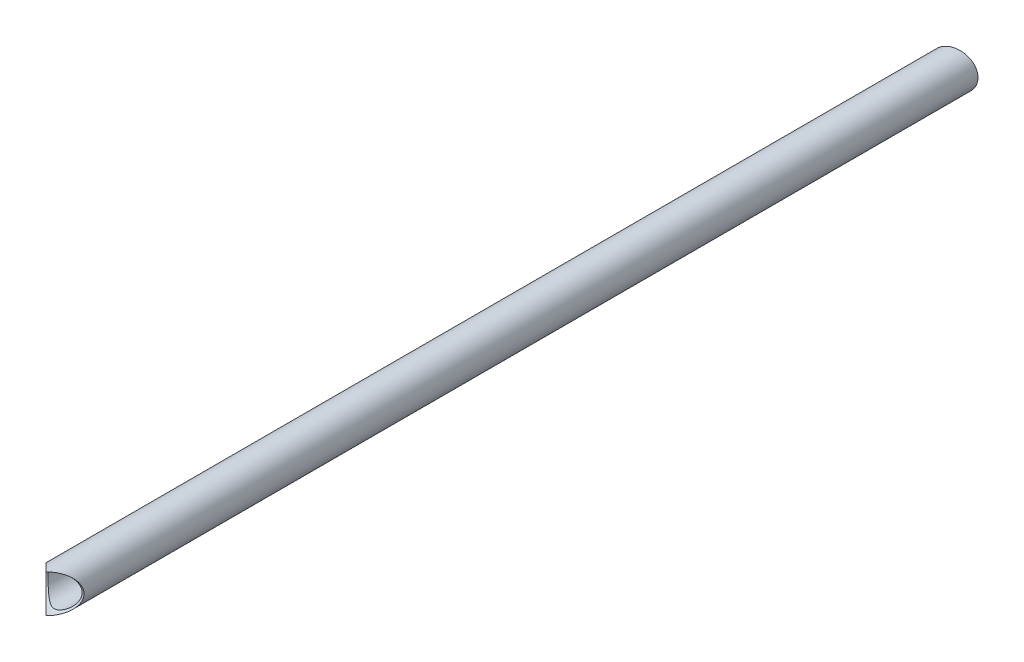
ISO-10303-21;
HEADER;
FILE_DESCRIPTION(('STEP AP214'),'2;1');
FILE_NAME('part.step','',(''),(''),'','','');
FILE_SCHEMA(('AUTOMOTIVE_DESIGN { 1 0 10303 214 1 1 1 1 }'));
ENDSEC;
DATA;
#1=APPLICATION_CONTEXT('core data for automotive mechanical design processes');
#2=APPLICATION_PROTOCOL_DEFINITION('international standard','automotive_design',2000,#1);
#3=PRODUCT_CONTEXT('',#1,'mechanical');
#4=PRODUCT('Part','Part','',(#3));
#5=PRODUCT_RELATED_PRODUCT_CATEGORY('part','',(#4));
#6=PRODUCT_DEFINITION_FORMATION('','',#4);
#7=PRODUCT_DEFINITION_CONTEXT('part definition',#1,'design');
#8=PRODUCT_DEFINITION('design','',#6,#7);
#9=PRODUCT_DEFINITION_SHAPE('','',#8);
#10=(LENGTH_UNIT() NAMED_UNIT(*) SI_UNIT(.MILLI.,.METRE.));
#11=(NAMED_UNIT(*) PLANE_ANGLE_UNIT() SI_UNIT($,.RADIAN.));
#12=(NAMED_UNIT(*) SI_UNIT($,.STERADIAN.) SOLID_ANGLE_UNIT());
#13=UNCERTAINTY_MEASURE_WITH_UNIT(LENGTH_MEASURE(1.E-05),#10,'distance_accuracy_value','');
#14=(GEOMETRIC_REPRESENTATION_CONTEXT(3) GLOBAL_UNCERTAINTY_ASSIGNED_CONTEXT((#13)) GLOBAL_UNIT_ASSIGNED_CONTEXT((#10,
#11,#12)) REPRESENTATION_CONTEXT('',''));
#15=CARTESIAN_POINT('',(0.,0.,0.));
#16=DIRECTION('',(0.,0.,1.));
#17=DIRECTION('',(1.,0.,0.));
#18=AXIS2_PLACEMENT_3D('',#15,#16,#17);
#19=CARTESIAN_POINT('',(0.,0.,360.));
#20=DIRECTION('',(0.,0.,-1.));
#21=DIRECTION('',(-1.,0.,0.));
#22=AXIS2_PLACEMENT_3D('',#19,#20,#21);
#23=CYLINDRICAL_SURFACE('',#22,15.);
#24=CARTESIAN_POINT('',(0.,0.,360.));
#25=DIRECTION('',(-0.707106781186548,0.,-0.707106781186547));
#26=DIRECTION('',(0.707106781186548,0.,-0.707106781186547));
#27=AXIS2_PLACEMENT_3D('',#24,#25,#26);
#28=ELLIPSE('',#27,21.2132034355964,15.);
#29=CARTESIAN_POINT('',(0.,15.,360.));
#30=VERTEX_POINT('',#29);
#31=CARTESIAN_POINT('',(0.,-15.,360.));
#32=VERTEX_POINT('',#31);
#33=EDGE_CURVE('E47',#30,#32,#28,.T.);
#34=ORIENTED_EDGE('',*,*,#33,.T.);
#35=CARTESIAN_POINT('',(0.,0.,360.));
#36=DIRECTION('',(0.707106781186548,0.,-0.707106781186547));
#37=DIRECTION('',(-0.707106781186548,0.,-0.707106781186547));
#38=AXIS2_PLACEMENT_3D('',#35,#36,#37);
#39=ELLIPSE('',#38,21.2132034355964,15.);
#40=EDGE_CURVE('E40',#32,#30,#39,.T.);
#41=ORIENTED_EDGE('',*,*,#40,.T.);
#42=EDGE_LOOP('',(#34,#41));
#43=FACE_BOUND('',#42,.T.);
#44=CARTESIAN_POINT('',(0.,0.,-355.980762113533));
#45=DIRECTION('',(0.258819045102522,0.,0.965925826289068));
#46=DIRECTION('',(0.965925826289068,0.,-0.258819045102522));
#47=AXIS2_PLACEMENT_3D('',#44,#45,#46);
#48=ELLIPSE('',#47,15.5291427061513,15.);
#49=CARTESIAN_POINT('',(15.,0.,-360.));
#50=VERTEX_POINT('',#49);
#51=EDGE_CURVE('E59',#50,#50,#48,.T.);
#52=ORIENTED_EDGE('',*,*,#51,.T.);
#53=EDGE_LOOP('',(#52));
#54=FACE_BOUND('',#53,.T.);
#55=ADVANCED_FACE('F33',(#43,#54),#23,.T.);
#56=CARTESIAN_POINT('',(0.,0.,360.));
#57=DIRECTION('',(0.,0.,-1.));
#58=DIRECTION('',(-1.,0.,0.));
#59=AXIS2_PLACEMENT_3D('',#56,#57,#58);
#60=CYLINDRICAL_SURFACE('',#59,13.5);
#61=CARTESIAN_POINT('',(0.,0.,-355.980762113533));
#62=DIRECTION('',(0.258819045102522,0.,0.965925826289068));
#63=DIRECTION('',(0.965925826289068,0.,-0.258819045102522));
#64=AXIS2_PLACEMENT_3D('',#61,#62,#63);
#65=ELLIPSE('',#64,13.9762284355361,13.5);
#66=CARTESIAN_POINT('',(13.5,0.,-359.598076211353));
#67=VERTEX_POINT('',#66);
#68=EDGE_CURVE('E11',#67,#67,#65,.T.);
#69=ORIENTED_EDGE('',*,*,#68,.F.);
#70=EDGE_LOOP('',(#69));
#71=FACE_BOUND('',#70,.T.);
#72=CARTESIAN_POINT('',(-13.5,0.,345.));
#73=CARTESIAN_POINT('',(-13.499997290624,0.312887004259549,345.000002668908));
#74=CARTESIAN_POINT('',(-13.4891011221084,0.625818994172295,345.00981130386));
#75=CARTESIAN_POINT('',(-13.4457291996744,1.24899181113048,345.048827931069));
#76=CARTESIAN_POINT('',(-13.4132492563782,1.55923210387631,345.078039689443));
#77=CARTESIAN_POINT('',(-13.3273181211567,2.17467421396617,345.155234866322));
#78=CARTESIAN_POINT('',(-13.2738498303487,2.47987171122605,345.203233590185));
#79=CARTESIAN_POINT('',(-13.1469391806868,3.08267339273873,345.316975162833));
#80=CARTESIAN_POINT('',(-13.0734973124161,3.38027776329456,345.382717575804));
#81=CARTESIAN_POINT('',(-12.9084227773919,3.96409642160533,345.530168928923));
#82=CARTESIAN_POINT('',(-12.8169114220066,4.25037215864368,345.611771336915));
#83=CARTESIAN_POINT('',(-12.6167630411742,4.81208905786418,345.789770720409));
#84=CARTESIAN_POINT('',(-12.5081262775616,5.08753038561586,345.886167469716));
#85=CARTESIAN_POINT('',(-12.2751121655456,5.62653010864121,346.092253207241));
#86=CARTESIAN_POINT('',(-12.1507331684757,5.89008725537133,346.201943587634));
#87=CARTESIAN_POINT('',(-11.8875926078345,6.40458207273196,346.433095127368));
#88=CARTESIAN_POINT('',(-11.7488278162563,6.65551689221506,346.554558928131));
#89=CARTESIAN_POINT('',(-11.4005753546,7.24116700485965,346.857961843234));
#90=CARTESIAN_POINT('',(-11.1848558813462,7.56966795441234,347.044789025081));
#91=CARTESIAN_POINT('',(-10.7309180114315,8.20052084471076,347.43460860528));
#92=CARTESIAN_POINT('',(-10.4926913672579,8.50286312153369,347.637606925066));
#93=CARTESIAN_POINT('',(-9.9957337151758,9.08191547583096,348.056518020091));
#94=CARTESIAN_POINT('',(-9.73696008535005,9.35856954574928,348.272457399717));
#95=CARTESIAN_POINT('',(-9.2012556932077,9.88575385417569,348.71328578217));
#96=CARTESIAN_POINT('',(-8.92432730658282,10.1362874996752,348.938173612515));
#97=CARTESIAN_POINT('',(-8.34680702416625,10.6172181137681,349.39867651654));
#98=CARTESIAN_POINT('',(-8.04581411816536,10.8470099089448,349.634419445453));
#99=CARTESIAN_POINT('',(-7.4263948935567,11.2801396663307,350.107514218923));
#100=CARTESIAN_POINT('',(-7.10796386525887,11.4834704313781,350.344866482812));
#101=CARTESIAN_POINT('',(-6.45388931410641,11.8633952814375,350.815710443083));
#102=CARTESIAN_POINT('',(-6.11827796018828,12.0400370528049,351.049208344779));
#103=CARTESIAN_POINT('',(-5.4279098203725,12.3666330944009,351.50618066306));
#104=CARTESIAN_POINT('',(-5.07316549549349,12.5166044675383,351.729661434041));
#105=CARTESIAN_POINT('',(-4.52527735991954,12.7204393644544,352.049749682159));
#106=CARTESIAN_POINT('',(-4.34031901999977,12.7847802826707,352.153773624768));
#107=CARTESIAN_POINT('',(-3.96455383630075,12.9062509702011,352.35523179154));
#108=CARTESIAN_POINT('',(-3.7737483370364,12.9633823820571,352.45266751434));
#109=CARTESIAN_POINT('',(-3.38598306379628,13.0700239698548,352.638886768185));
#110=CARTESIAN_POINT('',(-3.1890265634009,13.1195381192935,352.727674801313));
#111=CARTESIAN_POINT('',(-2.78861299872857,13.210441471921,352.894141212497));
#112=CARTESIAN_POINT('',(-2.58515693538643,13.2518319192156,352.971821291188));
#113=CARTESIAN_POINT('',(-2.20675064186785,13.3195602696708,353.10117996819));
#114=CARTESIAN_POINT('',(-2.03279230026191,13.3472598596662,353.155034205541));
#115=CARTESIAN_POINT('',(-1.68082762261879,13.3961323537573,353.251181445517));
#116=CARTESIAN_POINT('',(-1.50282263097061,13.4173073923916,353.293478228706));
#117=CARTESIAN_POINT('',(-1.14384682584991,13.4526598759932,353.364675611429));
#118=CARTESIAN_POINT('',(-0.962883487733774,13.4668527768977,353.393605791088));
#119=CARTESIAN_POINT('',(-0.598774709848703,13.4879468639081,353.436778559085));
#120=CARTESIAN_POINT('',(-0.415629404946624,13.4948484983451,353.451022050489));
#121=CARTESIAN_POINT('',(-0.0476462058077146,13.5011767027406,353.464077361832));
#122=CARTESIAN_POINT('',(0.137195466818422,13.5005621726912,353.46280433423));
#123=CARTESIAN_POINT('',(0.505923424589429,13.4917774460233,353.444693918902));
#124=CARTESIAN_POINT('',(0.689809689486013,13.483607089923,353.427856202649));
#125=CARTESIAN_POINT('',(1.05546145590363,13.459926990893,353.379495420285));
#126=CARTESIAN_POINT('',(1.23722268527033,13.4444044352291,353.347946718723));
#127=CARTESIAN_POINT('',(1.59724637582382,13.406401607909,353.271686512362));
#128=CARTESIAN_POINT('',(1.77550739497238,13.3839185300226,353.226969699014));
#129=CARTESIAN_POINT('',(2.2032535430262,13.3214229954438,353.104624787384));
#130=CARTESIAN_POINT('',(2.45055779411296,13.2780267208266,353.021102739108));
#131=CARTESIAN_POINT('',(2.93591778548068,13.1792195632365,352.836262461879));
#132=CARTESIAN_POINT('',(3.17396819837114,13.1238018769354,352.73493416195));
#133=CARTESIAN_POINT('',(3.64178293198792,13.001770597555,352.518728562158));
#134=CARTESIAN_POINT('',(3.87151757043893,12.9351209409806,352.403807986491));
#135=CARTESIAN_POINT('',(4.32259691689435,12.7914506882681,352.164292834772));
#136=CARTESIAN_POINT('',(4.54393846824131,12.7144262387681,352.039694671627));
#137=CARTESIAN_POINT('',(4.96266703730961,12.5565996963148,351.793197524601));
#138=CARTESIAN_POINT('',(5.16061119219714,12.4765048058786,351.671787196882));
#139=CARTESIAN_POINT('',(5.55033529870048,12.3080796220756,351.424829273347));
#140=CARTESIAN_POINT('',(5.7421142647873,12.2197480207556,351.299281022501));
#141=CARTESIAN_POINT('',(6.30900413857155,11.9425169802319,350.918440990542));
#142=CARTESIAN_POINT('',(6.67549744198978,11.7414461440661,350.65905732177));
#143=CARTESIAN_POINT('',(7.38706687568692,11.3072910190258,350.137929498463));
#144=CARTESIAN_POINT('',(7.73214319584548,11.0742070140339,349.876185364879));
#145=CARTESIAN_POINT('',(8.40103138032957,10.5757509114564,349.356549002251));
#146=CARTESIAN_POINT('',(8.72485220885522,10.3103925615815,349.098655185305));
#147=CARTESIAN_POINT('',(9.30548255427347,9.78713649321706,348.628216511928));
#148=CARTESIAN_POINT('',(9.56525058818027,9.53360432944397,348.414462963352));
#149=CARTESIAN_POINT('',(10.0671344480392,9.00202238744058,347.996757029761));
#150=CARTESIAN_POINT('',(10.30924920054,8.72397112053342,347.792805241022));
#151=CARTESIAN_POINT('',(10.7734610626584,8.14372962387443,347.398311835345));
#152=CARTESIAN_POINT('',(10.9955925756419,7.84158263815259,347.20774729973));
#153=CARTESIAN_POINT('',(11.4178197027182,7.2129499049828,346.843051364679));
#154=CARTESIAN_POINT('',(11.6179215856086,6.88647112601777,346.668915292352));
#155=CARTESIAN_POINT('',(11.9501286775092,6.28755121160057,346.378301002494));
#156=CARTESIAN_POINT('',(12.0873046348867,6.01988433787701,346.25775749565));
#157=CARTESIAN_POINT('',(12.3453296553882,5.47125928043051,346.030266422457));
#158=CARTESIAN_POINT('',(12.4661825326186,5.19030422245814,345.923315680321));
#159=CARTESIAN_POINT('',(12.6899888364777,4.61617537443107,345.724736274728));
#160=CARTESIAN_POINT('',(12.7929471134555,4.32300492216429,345.633103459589));
#161=CARTESIAN_POINT('',(12.9794459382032,3.7258307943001,345.466788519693));
#162=CARTESIAN_POINT('',(13.0629862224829,3.42182697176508,345.39210662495));
#163=CARTESIAN_POINT('',(13.209751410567,2.80258165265,345.260717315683));
#164=CARTESIAN_POINT('',(13.2728179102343,2.48727256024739,345.204150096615));
#165=CARTESIAN_POINT('',(13.3765283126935,1.85004756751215,345.111044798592));
#166=CARTESIAN_POINT('',(13.4171721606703,1.52813165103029,345.074506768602));
#167=CARTESIAN_POINT('',(13.4751624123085,0.880673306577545,345.022355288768));
#168=CARTESIAN_POINT('',(13.4925201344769,0.555132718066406,345.006731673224));
#169=CARTESIAN_POINT('',(13.5035870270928,-0.0966590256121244,344.996771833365));
#170=CARTESIAN_POINT('',(13.497298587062,-0.422910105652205,345.002433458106));
#171=CARTESIAN_POINT('',(13.4633537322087,-1.0347191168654,345.032974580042));
#172=CARTESIAN_POINT('',(13.438300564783,-1.32054520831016,345.055512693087));
#173=CARTESIAN_POINT('',(13.370340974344,-1.88830798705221,345.116593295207));
#174=CARTESIAN_POINT('',(13.3274362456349,-2.17024504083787,345.155134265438));
#175=CARTESIAN_POINT('',(13.2244585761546,-2.72841614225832,345.247515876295));
#176=CARTESIAN_POINT('',(13.1643845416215,-3.00464982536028,345.30135749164));
#177=CARTESIAN_POINT('',(13.0279608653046,-3.54981751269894,345.423414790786));
#178=CARTESIAN_POINT('',(12.9516103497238,-3.8187511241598,345.491631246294));
#179=CARTESIAN_POINT('',(12.7816220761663,-4.3544241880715,345.643177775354));
#180=CARTESIAN_POINT('',(12.6876094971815,-4.62095171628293,345.726834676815));
#181=CARTESIAN_POINT('',(12.4847276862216,-5.14395692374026,345.906872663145));
#182=CARTESIAN_POINT('',(12.3758527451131,-5.40043069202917,346.003258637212));
#183=CARTESIAN_POINT('',(12.1444553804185,-5.90242246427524,346.207435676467));
#184=CARTESIAN_POINT('',(12.0219330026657,-6.14794050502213,346.315226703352));
#185=CARTESIAN_POINT('',(11.7643642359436,-6.6275071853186,346.540935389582));
#186=CARTESIAN_POINT('',(11.6293152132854,-6.86155339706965,346.658855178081));
#187=CARTESIAN_POINT('',(11.2775389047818,-7.43158776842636,346.964588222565));
#188=CARTESIAN_POINT('',(11.0536565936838,-7.76022900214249,347.157938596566));
#189=CARTESIAN_POINT('',(10.5832237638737,-8.39048022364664,347.560554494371));
#190=CARTESIAN_POINT('',(10.3366635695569,-8.69207856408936,347.769826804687));
#191=CARTESIAN_POINT('',(9.82272494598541,-9.26896415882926,348.201004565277));
#192=CARTESIAN_POINT('',(9.5552940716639,-9.54418098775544,348.422941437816));
#193=CARTESIAN_POINT('',(9.00202723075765,-10.0676987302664,348.875204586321));
#194=CARTESIAN_POINT('',(8.71619421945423,-10.3160039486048,349.105529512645));
#195=CARTESIAN_POINT('',(8.12036863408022,-10.7915830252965,349.576172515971));
#196=CARTESIAN_POINT('',(7.80997182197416,-11.0182424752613,349.816598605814));
#197=CARTESIAN_POINT('',(7.1711229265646,-11.4443219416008,350.297899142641));
#198=CARTESIAN_POINT('',(6.84266462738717,-11.6437324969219,350.538773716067));
#199=CARTESIAN_POINT('',(6.16778158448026,-12.0148450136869,351.014771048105));
#200=CARTESIAN_POINT('',(5.82139831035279,-12.1866074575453,351.249905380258));
#201=CARTESIAN_POINT('',(5.10822142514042,-12.5023255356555,351.707307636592));
#202=CARTESIAN_POINT('',(4.74144481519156,-12.6463038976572,351.929585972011));
#203=CARTESIAN_POINT('',(4.18420502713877,-12.8365861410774,352.238831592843));
#204=CARTESIAN_POINT('',(4.00289099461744,-12.8943255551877,352.335279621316));
#205=CARTESIAN_POINT('',(3.63464072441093,-13.0029350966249,352.52101241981));
#206=CARTESIAN_POINT('',(3.44770363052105,-13.0538041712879,352.610296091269));
#207=CARTESIAN_POINT('',(2.8782420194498,-13.195391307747,352.864248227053));
#208=CARTESIAN_POINT('',(2.48639545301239,-13.2753226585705,353.015406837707));
#209=CARTESIAN_POINT('',(1.9142102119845,-13.3646970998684,353.189105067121));
#210=CARTESIAN_POINT('',(1.74309834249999,-13.388126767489,353.235377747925));
#211=CARTESIAN_POINT('',(1.39739669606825,-13.4286085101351,353.316101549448));
#212=CARTESIAN_POINT('',(1.22280874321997,-13.4456638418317,353.350558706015));
#213=CARTESIAN_POINT('',(0.871279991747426,-13.4730061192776,353.406133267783));
#214=CARTESIAN_POINT('',(0.694343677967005,-13.4833044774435,353.427273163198));
#215=CARTESIAN_POINT('',(0.339063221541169,-13.4969117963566,353.455260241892));
#216=CARTESIAN_POINT('',(0.16071912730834,-13.5002209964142,353.46210791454));
#217=CARTESIAN_POINT('',(-0.196367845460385,-13.4997554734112,353.461146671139));
#218=CARTESIAN_POINT('',(-0.375110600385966,-13.4959629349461,353.453300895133));
#219=CARTESIAN_POINT('',(-0.731087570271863,-13.4813669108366,353.423297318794));
#220=CARTESIAN_POINT('',(-0.908321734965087,-13.470563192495,353.401139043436));
#221=CARTESIAN_POINT('',(-1.26036272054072,-13.4421997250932,353.34355288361));
#222=CARTESIAN_POINT('',(-1.43516476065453,-13.4246282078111,353.308101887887));
#223=CARTESIAN_POINT('',(-1.78122128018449,-13.3831106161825,353.225453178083));
#224=CARTESIAN_POINT('',(-1.95247436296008,-13.3591620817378,353.178250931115));
#225=CARTESIAN_POINT('',(-2.38295954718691,-13.290653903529,353.045381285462));
#226=CARTESIAN_POINT('',(-2.63939156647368,-13.2419679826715,352.952755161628));
#227=CARTESIAN_POINT('',(-3.14214304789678,-13.131766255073,352.749477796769));
#228=CARTESIAN_POINT('',(-3.38845566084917,-13.0702419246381,352.63881459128));
#229=CARTESIAN_POINT('',(-3.87223743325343,-12.9351870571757,352.403991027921));
#230=CARTESIAN_POINT('',(-4.10967147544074,-12.861613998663,352.279783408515));
#231=CARTESIAN_POINT('',(-4.57550622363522,-12.7033559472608,352.022053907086));
#232=CARTESIAN_POINT('',(-4.80390795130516,-12.6186722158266,351.888533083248));
#233=CARTESIAN_POINT('',(-5.23156049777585,-12.4470390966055,351.627828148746));
#234=CARTESIAN_POINT('',(-5.43154328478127,-12.3610377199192,351.501214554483));
#235=CARTESIAN_POINT('',(-5.82522883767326,-12.1804594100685,351.244368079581));
#236=CARTESIAN_POINT('',(-6.01893069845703,-12.0858812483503,351.114134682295));
#237=CARTESIAN_POINT('',(-6.59137527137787,-11.789349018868,350.719956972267));
#238=CARTESIAN_POINT('',(-6.96129472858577,-11.5746627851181,350.452636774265));
#239=CARTESIAN_POINT('',(-7.6786798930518,-11.1117019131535,349.917568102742));
#240=CARTESIAN_POINT('',(-8.02615588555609,-10.8634428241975,349.649819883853));
#241=CARTESIAN_POINT('',(-8.69857865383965,-10.3328600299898,349.120089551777));
#242=CARTESIAN_POINT('',(-9.02353569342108,-10.0505520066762,348.858104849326));
#243=CARTESIAN_POINT('',(-9.59039879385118,-9.50777479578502,348.393766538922));
#244=CARTESIAN_POINT('',(-9.83640899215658,-9.25322970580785,348.189485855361));
#245=CARTESIAN_POINT('',(-10.3112358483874,-8.72098536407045,347.791197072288));
#246=CARTESIAN_POINT('',(-10.5400519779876,-8.44328540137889,347.597189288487));
#247=CARTESIAN_POINT('',(-10.9782161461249,-7.86512154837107,347.222741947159));
#248=CARTESIAN_POINT('',(-11.1875923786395,-7.56469180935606,347.042282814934));
#249=CARTESIAN_POINT('',(-11.5848353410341,-6.94104966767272,346.697795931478));
#250=CARTESIAN_POINT('',(-11.7727078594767,-6.61784343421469,346.533763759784));
#251=CARTESIAN_POINT('',(-12.0863118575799,-6.02153068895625,346.258654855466));
#252=CARTESIAN_POINT('',(-12.2167129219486,-5.75262306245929,346.143781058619));
#253=CARTESIAN_POINT('',(-12.4610859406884,-5.20211305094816,345.927850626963));
#254=CARTESIAN_POINT('',(-12.5750614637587,-4.92051344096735,345.826790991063));
#255=CARTESIAN_POINT('',(-12.7849671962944,-4.34603642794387,345.640227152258));
#256=CARTESIAN_POINT('',(-12.8809174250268,-4.05317197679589,345.55470569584));
#257=CARTESIAN_POINT('',(-13.0534368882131,-3.45743827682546,345.400660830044));
#258=CARTESIAN_POINT('',(-13.1300101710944,-3.15457113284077,345.332133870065));
#259=CARTESIAN_POINT('',(-13.2460900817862,-2.61667849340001,345.228120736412));
#260=CARTESIAN_POINT('',(-13.2900804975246,-2.3833754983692,345.188654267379));
#261=CARTESIAN_POINT('',(-13.3658596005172,-1.91323450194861,345.120620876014));
#262=CARTESIAN_POINT('',(-13.3976497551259,-1.67639692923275,345.092052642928));
#263=CARTESIAN_POINT('',(-13.4486729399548,-1.20022570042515,345.046181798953));
#264=CARTESIAN_POINT('',(-13.4679029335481,-0.960891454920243,345.028881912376));
#265=CARTESIAN_POINT('',(-13.4935661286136,-0.481046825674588,345.005791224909));
#266=CARTESIAN_POINT('',(-13.5000020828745,-0.240536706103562,344.999997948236));
#267=CARTESIAN_POINT('',(-13.5,0.,345.));
#268=B_SPLINE_CURVE_WITH_KNOTS('',3,(#72,#73,#74,#75,#76,#77,#78,#79,#80,#81,#82,#83,#84,#85,
#86,#87,#88,#89,#90,#91,#92,#93,#94,#95,#96,#97,#98,#99,#100,#101,#102,#103,#104,#105,#106,#107,
#108,#109,#110,#111,#112,#113,#114,#115,#116,#117,#118,#119,#120,#121,#122,#123,#124,#125,#126,
#127,#128,#129,#130,#131,#132,#133,#134,#135,#136,#137,#138,#139,#140,#141,#142,#143,#144,#145,
#146,#147,#148,#149,#150,#151,#152,#153,#154,#155,#156,#157,#158,#159,#160,#161,#162,#163,#164,
#165,#166,#167,#168,#169,#170,#171,#172,#173,#174,#175,#176,#177,#178,#179,#180,#181,#182,#183,
#184,#185,#186,#187,#188,#189,#190,#191,#192,#193,#194,#195,#196,#197,#198,#199,#200,#201,#202,
#203,#204,#205,#206,#207,#208,#209,#210,#211,#212,#213,#214,#215,#216,#217,#218,#219,#220,#221,
#222,#223,#224,#225,#226,#227,#228,#229,#230,#231,#232,#233,#234,#235,#236,#237,#238,#239,#240,
#241,#242,#243,#244,#245,#246,#247,#248,#249,#250,#251,#252,#253,#254,#255,#256,#257,#258,#259,
#260,#261,#262,#263,#264,#265,#266,#267),.UNSPECIFIED.,.T.,.F.,(4,2,2,2,2,2,2,2,2,2,2,2,2,2,2,2,
2,2,2,2,2,2,2,2,2,2,2,2,2,2,2,2,2,2,2,2,2,2,2,2,2,2,2,2,2,2,2,2,2,2,2,2,2,2,2,2,2,2,2,2,2,2,2,2,
2,2,2,2,2,2,2,2,2,2,2,2,2,2,2,2,2,2,2,2,2,2,2,2,2,2,2,2,2,2,2,2,2,4),(0.,0.938399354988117,
1.87698090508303,2.81632869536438,3.75565341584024,4.68887408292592,5.62208048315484,
6.55538469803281,7.48889879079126,8.79241565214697,10.0964120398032,11.4031878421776,
12.709792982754,14.0468410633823,15.3842520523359,16.7192444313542,18.053377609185,
18.7183802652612,19.3832311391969,20.0477340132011,20.7121350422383,21.2642776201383,
21.8162393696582,22.3669737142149,22.9176741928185,23.4713873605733,24.0251122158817,
24.5798056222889,25.1347229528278,25.9272146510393,26.7201560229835,27.5156936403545,
28.3115275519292,29.0481625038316,29.784914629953,31.2590460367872,32.7331643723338,
34.2066569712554,35.4693085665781,36.7320368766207,37.9925479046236,39.2526993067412,
40.2239067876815,41.1948869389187,42.1656034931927,43.1363332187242,44.1144036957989,
45.0924765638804,46.0700738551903,47.0475723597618,47.9099713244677,48.7722884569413,
49.6346605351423,50.4970789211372,51.3804429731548,52.2641473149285,53.1478486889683,
54.0317362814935,55.3562685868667,56.6813686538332,58.00991292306,59.3382443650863,
60.6971001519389,62.0564265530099,63.4127376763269,64.7679345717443,65.4076441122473,
66.0474515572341,67.3246462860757,67.8606258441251,68.3963311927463,68.9311293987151,
69.4659092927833,70.0020325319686,70.5381735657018,71.0752511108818,71.612536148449,
72.4419988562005,73.2720140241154,74.1050241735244,74.9379398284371,75.6931692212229,
76.448506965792,77.9597875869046,79.4703706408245,80.9802606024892,82.2053636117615,
83.4305042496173,84.6538393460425,85.8768443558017,86.8364893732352,87.795925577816,
88.754289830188,89.7124536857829,90.4339303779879,91.1553202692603,91.8768845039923,
92.5982934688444),.UNSPECIFIED.);
#269=CARTESIAN_POINT('',(-13.5,0.,345.));
#270=VERTEX_POINT('',#269);
#271=EDGE_CURVE('E50',#270,#270,#268,.T.);
#272=ORIENTED_EDGE('',*,*,#271,.F.);
#273=EDGE_LOOP('',(#272));
#274=FACE_BOUND('',#273,.T.);
#275=ADVANCED_FACE('F60',(#71,#274),#60,.F.);
#276=CARTESIAN_POINT('',(-20.,0.,360.));
#277=DIRECTION('',(1.,0.,0.));
#278=DIRECTION('',(0.,0.,-1.));
#279=AXIS2_PLACEMENT_3D('',#276,#277,#278);
#280=CYLINDRICAL_SURFACE('',#279,15.);
#281=ORIENTED_EDGE('',*,*,#271,.T.);
#282=EDGE_LOOP('',(#281));
#283=FACE_BOUND('',#282,.T.);
#284=ORIENTED_EDGE('',*,*,#33,.F.);
#285=ORIENTED_EDGE('',*,*,#40,.F.);
#286=EDGE_LOOP('',(#284,#285));
#287=FACE_BOUND('',#286,.T.);
#288=ADVANCED_FACE('F48',(#283,#287),#280,.F.);
#289=CARTESIAN_POINT('',(15.,901.561146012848,-360.));
#290=DIRECTION('',(0.258819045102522,0.,0.965925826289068));
#291=DIRECTION('',(0.965925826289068,0.,-0.258819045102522));
#292=AXIS2_PLACEMENT_3D('',#289,#290,#291);
#293=PLANE('',#292);
#294=ORIENTED_EDGE('',*,*,#68,.T.);
#295=EDGE_LOOP('',(#294));
#296=FACE_BOUND('',#295,.T.);
#297=ORIENTED_EDGE('',*,*,#51,.F.);
#298=EDGE_LOOP('',(#297));
#299=FACE_BOUND('',#298,.T.);
#300=ADVANCED_FACE('F65',(#296,#299),#293,.F.);
#301=CLOSED_SHELL('',(#55,#275,#288,#300));
#302=MANIFOLD_SOLID_BREP('B2',#301);
#303=ADVANCED_BREP_SHAPE_REPRESENTATION('',(#18,#302),#14);
#304=SHAPE_DEFINITION_REPRESENTATION(#9,#303);
ENDSEC;
END-ISO-10303-21;
